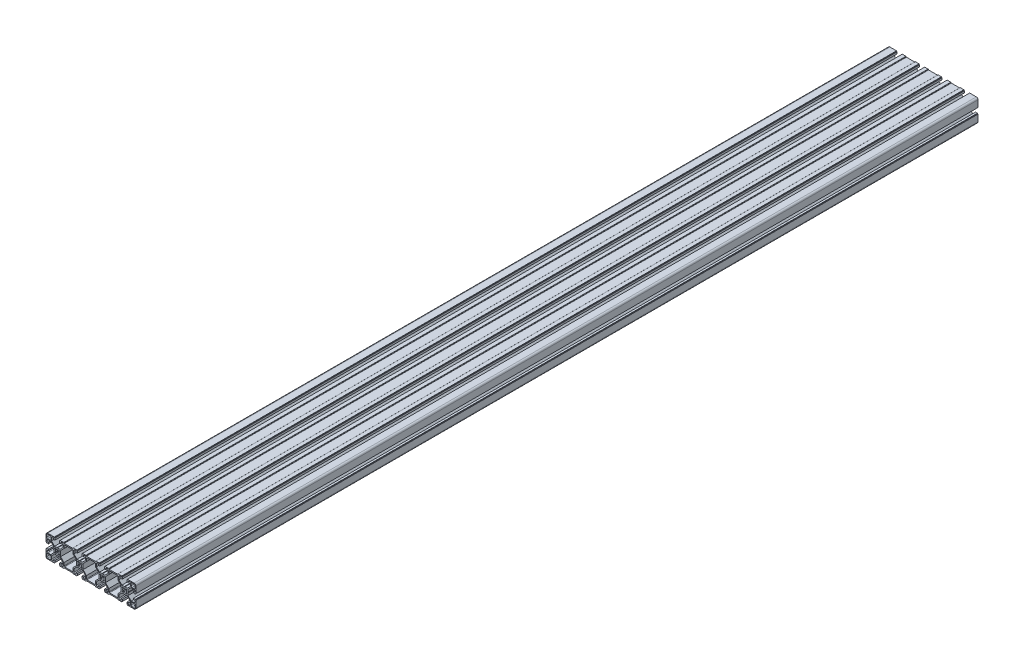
from build123d import *

# Parameters (mm, degrees)
EXTRUDE_1_DEPTH = 1500


with BuildPart() as part:
    # Sketch 1 → Extrude 1 (new body)
    with BuildSketch(Plane.XY):
        with BuildLine():
            Line((-46.46195512, 18.20767413), (-46.46195512, 18.18767413))
            ThreePointArc((-46.46195512, 18.18767413), (-46.318437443, 17.841191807), (-45.97195512, 17.69767413))
            Line((-45.97195512, 17.69767413), (-31.048621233, 17.69767413))
            ThreePointArc((-31.048621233, 17.69767413), (-30.70213891, 17.841191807), (-30.558621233, 18.18767413))
            Line((-30.558621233, 18.18767413), (-30.558621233, 18.20767413))
            ThreePointArc((-30.558621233, 18.20767413), (-30.415103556, 18.554156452), (-30.068621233, 18.69767413))
            Line((-30.068621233, 18.69767413), (-23.611627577, 18.69767413))
            Line((-23.611627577, 18.69767413), (-23.611627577, 17.69767413))
            Line((-23.611627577, 17.69767413), (-22.611627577, 17.69767413))
            Line((-22.611627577, 17.69767413), (-22.611627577, 14.29767413))
            Line((-22.611627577, 14.29767413), (-24.911627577, 14.29767413))
            Line((-24.911627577, 14.29767413), (-24.911627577, 15.49767413))
            ThreePointArc((-24.911627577, 15.49767413), (-25.350967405, 16.558334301), (-26.411627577, 16.99767413))
            Line((-26.411627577, 16.99767413), (-27.259656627, 16.99767413))
            ThreePointArc((-27.259656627, 16.99767413), (-28.320316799, 16.558334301), (-28.759656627, 15.49767413))
            Line((-28.759656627, 15.49767413), (-28.759656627, 10.212152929))
            Line((-28.759656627, 10.212152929), (-23.244124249, 4.69373497))
            Line((-23.244124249, 4.69373497), (-19.014798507, 4.69373497))
            Line((-19.014798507, 4.69373497), (-18.519368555, 4.198305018))
            Line((-18.519368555, 4.198305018), (-18.023938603, 4.69373497))
            Line((-18.023938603, 4.69373497), (-13.794612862, 4.69373497))
            Line((-13.794612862, 4.69373497), (-8.262990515, 10.231508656))
            Line((-8.262990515, 10.231508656), (-8.262990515, 15.49767413))
            ThreePointArc((-8.262990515, 15.49767413), (-8.702330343, 16.558334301), (-9.762990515, 16.99767413))
            Line((-9.762990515, 16.99767413), (-10.611627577, 16.99767413))
            ThreePointArc((-10.611627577, 16.99767413), (-11.672287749, 16.558334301), (-12.111627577, 15.49767413))
            Line((-12.111627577, 15.49767413), (-12.111627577, 14.29767413))
            Line((-12.111627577, 14.29767413), (-14.411627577, 14.29767413))
            Line((-14.411627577, 14.29767413), (-14.411627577, 17.69767413))
            Line((-14.411627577, 17.69767413), (-13.411627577, 17.69767413))
            Line((-13.411627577, 17.69767413), (-13.411627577, 18.69767413))
            Line((-13.411627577, 18.69767413), (-7.482990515, 18.69767413))
            ThreePointArc((-7.482990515, 18.69767413), (-7.136508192, 18.554156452), (-6.992990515, 18.20767413))
            Line((-6.992990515, 18.20767413), (-6.992990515, 18.18767413))
            ThreePointArc((-6.992990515, 18.18767413), (-6.849472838, 17.841191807), (-6.502990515, 17.69767413))
            Line((-6.502990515, 17.69767413), (9.480343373, 17.69767413))
            ThreePointArc((9.480343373, 17.69767413), (9.826825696, 17.841191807), (9.970343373, 18.18767413))
            Line((9.970343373, 18.18767413), (9.970343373, 18.20767413))
            ThreePointArc((9.970343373, 18.20767413), (10.11386105, 18.554156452), (10.460343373, 18.69767413))
            Line((10.460343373, 18.69767413), (16.388372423, 18.69767413))
            Line((16.388372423, 18.69767413), (16.388372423, 17.69767413))
            Line((16.388372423, 17.69767413), (17.388372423, 17.69767413))
            Line((17.388372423, 17.69767413), (17.388372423, 14.29767413))
            Line((17.388372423, 14.29767413), (15.088372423, 14.29767413))
            Line((15.088372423, 14.29767413), (15.088372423, 15.49767413))
            ThreePointArc((15.088372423, 15.49767413), (14.649032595, 16.558334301), (13.588372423, 16.99767413))
            Line((13.588372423, 16.99767413), (12.740343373, 16.99767413))
            ThreePointArc((12.740343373, 16.99767413), (11.679683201, 16.558334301), (11.240343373, 15.49767413))
            Line((11.240343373, 15.49767413), (11.240343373, 10.212152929))
            Line((11.240343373, 10.212152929), (16.755875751, 4.69373497))
            Line((16.755875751, 4.69373497), (20.985201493, 4.69373497))
            Line((20.985201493, 4.69373497), (21.480631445, 4.198305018))
            Line((21.480631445, 4.198305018), (21.976061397, 4.69373497))
            Line((21.976061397, 4.69373497), (26.205387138, 4.69373497))
            Line((26.205387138, 4.69373497), (31.737009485, 10.231508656))
            Line((31.737009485, 10.231508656), (31.737009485, 15.49767413))
            ThreePointArc((31.737009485, 15.49767413), (31.297669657, 16.558334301), (30.237009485, 16.99767413))
            Line((30.237009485, 16.99767413), (29.388372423, 16.99767413))
            ThreePointArc((29.388372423, 16.99767413), (28.327712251, 16.558334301), (27.888372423, 15.49767413))
            Line((27.888372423, 15.49767413), (27.888372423, 14.29767413))
            Line((27.888372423, 14.29767413), (25.588372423, 14.29767413))
            Line((25.588372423, 14.29767413), (25.588372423, 17.69767413))
            Line((25.588372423, 17.69767413), (26.588372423, 17.69767413))
            Line((26.588372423, 17.69767413), (26.588372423, 18.69767413))
            Line((26.588372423, 18.69767413), (33.04804488, 18.69767413))
            ThreePointArc((33.04804488, 18.69767413), (33.394527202, 18.554156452), (33.53804488, 18.20767413))
            Line((33.53804488, 18.20767413), (33.53804488, 18.18767413))
            ThreePointArc((33.53804488, 18.18767413), (33.681562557, 17.841191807), (34.02804488, 17.69767413))
            Line((34.02804488, 17.69767413), (48.951378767, 17.69767413))
            ThreePointArc((48.951378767, 17.69767413), (49.29786109, 17.841191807), (49.441378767, 18.18767413))
            Line((49.441378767, 18.18767413), (49.441378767, 18.20767413))
            ThreePointArc((49.441378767, 18.20767413), (49.584896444, 18.554156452), (49.931378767, 18.69767413))
            Line((49.931378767, 18.69767413), (56.388372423, 18.69767413))
            Line((56.388372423, 18.69767413), (56.388372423, 17.69767413))
            Line((56.388372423, 17.69767413), (57.388372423, 17.69767413))
            Line((57.388372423, 17.69767413), (57.388372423, 14.29767413))
            Line((57.388372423, 14.29767413), (55.088372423, 14.29767413))
            Line((55.088372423, 14.29767413), (55.088372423, 15.49767413))
            ThreePointArc((55.088372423, 15.49767413), (54.649032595, 16.558334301), (53.588372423, 16.99767413))
            Line((53.588372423, 16.99767413), (52.740343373, 16.99767413))
            ThreePointArc((52.740343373, 16.99767413), (51.679683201, 16.558334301), (51.240343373, 15.49767413))
            Line((51.240343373, 15.49767413), (51.240343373, 10.212152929))
            Line((51.240343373, 10.212152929), (56.755875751, 4.69373497))
            Line((56.755875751, 4.69373497), (60.985201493, 4.69373497))
            Line((60.985201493, 4.69373497), (61.480631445, 4.198305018))
            Line((61.480631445, 4.198305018), (61.976061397, 4.69373497))
            Line((61.976061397, 4.69373497), (66.205387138, 4.69373497))
            Line((66.205387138, 4.69373497), (71.737009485, 10.231508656))
            Line((71.737009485, 10.231508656), (71.737009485, 15.49767413))
            ThreePointArc((71.737009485, 15.49767413), (71.297669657, 16.558334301), (70.237009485, 16.99767413))
            Line((70.237009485, 16.99767413), (69.388372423, 16.99767413))
            ThreePointArc((69.388372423, 16.99767413), (68.327712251, 16.558334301), (67.888372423, 15.49767413))
            Line((67.888372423, 15.49767413), (67.888372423, 14.29767413))
            Line((67.888372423, 14.29767413), (65.588372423, 14.29767413))
            Line((65.588372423, 14.29767413), (65.588372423, 17.69767413))
            Line((65.588372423, 17.69767413), (66.588372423, 17.69767413))
            Line((66.588372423, 17.69767413), (66.588372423, 18.69767413))
            Line((66.588372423, 18.69767413), (78.488372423, 18.69767413))
            ThreePointArc((78.488372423, 18.69767413), (80.609692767, 17.818994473), (81.488372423, 15.69767413))
            Line((81.488372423, 15.69767413), (81.488372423, 3.799754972))
            Line((81.488372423, 3.799754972), (80.483128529, 3.799754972))
            Line((80.483128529, 3.799754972), (80.483128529, 2.799754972))
            Line((80.483128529, 2.799754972), (77.083128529, 2.799754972))
            Line((77.083128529, 2.799754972), (77.083128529, 5.099754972))
            Line((77.083128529, 5.099754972), (78.283128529, 5.099754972))
            ThreePointArc((78.283128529, 5.099754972), (79.3437887, 5.539094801), (79.783128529, 6.599754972))
            Line((79.783128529, 6.599754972), (79.783128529, 7.443844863))
            ThreePointArc((79.783128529, 7.443844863), (79.3437887, 8.504505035), (78.283128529, 8.943844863))
            Line((78.283128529, 8.943844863), (73.005580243, 8.943844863))
            Line((73.005580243, 8.943844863), (67.483128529, 3.423792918))
            Line((67.483128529, 3.423792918), (67.483128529, -0.814026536))
            Line((67.483128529, -0.814026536), (66.991921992, -1.305233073))
            Line((66.991921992, -1.305233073), (67.483128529, -1.79643961))
            Line((67.483128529, -1.79643961), (67.483128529, -6.034259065))
            Line((67.483128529, -6.034259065), (73.006735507, -11.558235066))
            Line((73.006735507, -11.558235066), (78.283128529, -11.558235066))
            ThreePointArc((78.283128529, -11.558235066), (79.3437887, -11.118895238), (79.783128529, -10.058235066))
            Line((79.783128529, -10.058235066), (79.783128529, -9.202325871))
            ThreePointArc((79.783128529, -9.202325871), (79.3437887, -8.141665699), (78.283128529, -7.702325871))
            Line((78.283128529, -7.702325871), (77.083128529, -7.702325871))
            Line((77.083128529, -7.702325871), (77.083128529, -5.402325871))
            Line((77.083128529, -5.402325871), (80.483128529, -5.402325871))
            Line((80.483128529, -5.402325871), (80.483128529, -6.402325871))
            Line((80.483128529, -6.402325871), (81.488372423, -6.402325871))
            Line((81.488372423, -6.402325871), (81.488372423, -18.302325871))
            ThreePointArc((81.488372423, -18.302325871), (80.609692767, -20.423646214), (78.488372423, -21.302325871))
            Line((78.488372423, -21.302325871), (66.588372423, -21.302325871))
            Line((66.588372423, -21.302325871), (66.588372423, -20.302325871))
            Line((66.588372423, -20.302325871), (65.588372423, -20.302325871))
            Line((65.588372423, -20.302325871), (65.588372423, -16.902325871))
            Line((65.588372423, -16.902325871), (67.888372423, -16.902325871))
            Line((67.888372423, -16.902325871), (67.888372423, -18.102325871))
            ThreePointArc((67.888372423, -18.102325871), (68.327712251, -19.162986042), (69.388372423, -19.602325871))
            Line((69.388372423, -19.602325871), (70.233426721, -19.602325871))
            ThreePointArc((70.233426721, -19.602325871), (71.294086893, -19.162986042), (71.733426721, -18.102325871))
            Line((71.733426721, -18.102325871), (71.733426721, -12.824801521))
            Line((71.733426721, -12.824801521), (66.210317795, -7.30626503))
            Line((66.210317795, -7.30626503), (61.979036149, -7.30626503))
            Line((61.979036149, -7.30626503), (61.480452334, -6.807681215))
            Line((61.480452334, -6.807681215), (60.981868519, -7.30626503))
            Line((60.981868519, -7.30626503), (56.750586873, -7.30626503))
            Line((56.750586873, -7.30626503), (51.238372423, -12.79900317))
            Line((51.238372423, -12.79900317), (51.238372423, -18.10232587))
            ThreePointArc((51.238372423, -18.10232587), (51.677712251, -19.162986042), (52.738372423, -19.60232587))
            Line((52.738372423, -19.60232587), (53.588372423, -19.60232587))
            ThreePointArc((53.588372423, -19.60232587), (54.649032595, -19.162986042), (55.088372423, -18.10232587))
            Line((55.088372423, -18.10232587), (55.088372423, -16.90232587))
            Line((55.088372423, -16.90232587), (57.388372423, -16.90232587))
            Line((57.388372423, -16.90232587), (57.388372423, -20.30232587))
            Line((57.388372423, -20.30232587), (56.388372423, -20.30232587))
            Line((56.388372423, -20.30232587), (56.388372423, -21.30232587))
            Line((56.388372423, -21.30232587), (49.922642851, -21.30232587))
            ThreePointArc((49.922642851, -21.30232587), (49.576160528, -21.158808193), (49.432642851, -20.81232587))
            Line((49.432642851, -20.81232587), (49.432642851, -20.79232587))
            ThreePointArc((49.432642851, -20.79232587), (49.289125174, -20.445843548), (48.942642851, -20.30232587))
            Line((48.942642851, -20.30232587), (34.017697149, -20.30232587))
            ThreePointArc((34.017697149, -20.30232587), (33.671214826, -20.445843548), (33.527697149, -20.79232587))
            Line((33.527697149, -20.79232587), (33.527697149, -20.81232587))
            ThreePointArc((33.527697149, -20.81232587), (33.384179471, -21.158808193), (33.037697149, -21.30232587))
            Line((33.037697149, -21.30232587), (26.588372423, -21.30232587))
            Line((26.588372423, -21.30232587), (26.588372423, -20.30232587))
            Line((26.588372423, -20.30232587), (25.588372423, -20.30232587))
            Line((25.588372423, -20.30232587), (25.588372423, -16.90232587))
            Line((25.588372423, -16.90232587), (27.888372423, -16.90232587))
            Line((27.888372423, -16.90232587), (27.888372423, -18.10232587))
            ThreePointArc((27.888372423, -18.10232587), (28.327712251, -19.162986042), (29.388372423, -19.60232587))
            Line((29.388372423, -19.60232587), (30.233426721, -19.60232587))
            ThreePointArc((30.233426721, -19.60232587), (31.294086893, -19.162986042), (31.733426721, -18.10232587))
            Line((31.733426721, -18.10232587), (31.733426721, -12.824801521))
            Line((31.733426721, -12.824801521), (26.210317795, -7.30626503))
            Line((26.210317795, -7.30626503), (21.979036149, -7.30626503))
            Line((21.979036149, -7.30626503), (21.480452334, -6.807681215))
            Line((21.480452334, -6.807681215), (20.981868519, -7.30626503))
            Line((20.981868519, -7.30626503), (16.750586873, -7.30626503))
            Line((16.750586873, -7.30626503), (11.238372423, -12.79900317))
            Line((11.238372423, -12.79900317), (11.238372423, -18.10232587))
            ThreePointArc((11.238372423, -18.10232587), (11.677712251, -19.162986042), (12.738372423, -19.60232587))
            Line((12.738372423, -19.60232587), (13.588372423, -19.60232587))
            ThreePointArc((13.588372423, -19.60232587), (14.649032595, -19.162986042), (15.088372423, -18.10232587))
            Line((15.088372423, -18.10232587), (15.088372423, -16.90232587))
            Line((15.088372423, -16.90232587), (17.388372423, -16.90232587))
            Line((17.388372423, -16.90232587), (17.388372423, -20.30232587))
            Line((17.388372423, -20.30232587), (16.388372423, -20.30232587))
            Line((16.388372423, -20.30232587), (16.388372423, -21.30232587))
            Line((16.388372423, -21.30232587), (10.458372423, -21.30232587))
            ThreePointArc((10.458372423, -21.30232587), (10.1118901, -21.158808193), (9.968372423, -20.81232587))
            Line((9.968372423, -20.81232587), (9.968372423, -20.79232587))
            ThreePointArc((9.968372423, -20.79232587), (9.824854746, -20.445843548), (9.478372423, -20.30232587))
            Line((9.478372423, -20.30232587), (-6.506573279, -20.30232587))
            ThreePointArc((-6.506573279, -20.30232587), (-6.853055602, -20.445843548), (-6.996573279, -20.79232587))
            Line((-6.996573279, -20.79232587), (-6.996573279, -20.81232587))
            ThreePointArc((-6.996573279, -20.81232587), (-7.140090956, -21.158808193), (-7.486573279, -21.30232587))
            Line((-7.486573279, -21.30232587), (-13.411627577, -21.30232587))
            Line((-13.411627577, -21.30232587), (-13.411627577, -20.30232587))
            Line((-13.411627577, -20.30232587), (-14.411627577, -20.30232587))
            Line((-14.411627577, -20.30232587), (-14.411627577, -16.90232587))
            Line((-14.411627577, -16.90232587), (-12.111627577, -16.90232587))
            Line((-12.111627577, -16.90232587), (-12.111627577, -18.10232587))
            ThreePointArc((-12.111627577, -18.10232587), (-11.672287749, -19.162986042), (-10.611627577, -19.60232587))
            Line((-10.611627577, -19.60232587), (-9.766573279, -19.60232587))
            ThreePointArc((-9.766573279, -19.60232587), (-8.705913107, -19.162986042), (-8.266573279, -18.10232587))
            Line((-8.266573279, -18.10232587), (-8.266573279, -12.824801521))
            Line((-8.266573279, -12.824801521), (-13.789682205, -7.30626503))
            Line((-13.789682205, -7.30626503), (-18.020963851, -7.30626503))
            Line((-18.020963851, -7.30626503), (-18.519547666, -6.807681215))
            Line((-18.519547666, -6.807681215), (-19.018131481, -7.30626503))
            Line((-19.018131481, -7.30626503), (-23.249413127, -7.30626503))
            Line((-23.249413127, -7.30626503), (-28.761627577, -12.79900317))
            Line((-28.761627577, -12.79900317), (-28.761627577, -18.10232587))
            ThreePointArc((-28.761627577, -18.10232587), (-28.322287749, -19.162986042), (-27.261627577, -19.60232587))
            Line((-27.261627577, -19.60232587), (-26.411627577, -19.60232587))
            ThreePointArc((-26.411627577, -19.60232587), (-25.350967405, -19.162986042), (-24.911627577, -18.10232587))
            Line((-24.911627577, -18.10232587), (-24.911627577, -16.90232587))
            Line((-24.911627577, -16.90232587), (-22.611627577, -16.90232587))
            Line((-22.611627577, -16.90232587), (-22.611627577, -20.30232587))
            Line((-22.611627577, -20.30232587), (-23.611627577, -20.30232587))
            Line((-23.611627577, -20.30232587), (-23.611627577, -21.30232587))
            Line((-23.611627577, -21.30232587), (-30.077357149, -21.30232587))
            ThreePointArc((-30.077357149, -21.30232587), (-30.423839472, -21.158808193), (-30.567357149, -20.81232587))
            Line((-30.567357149, -20.81232587), (-30.567357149, -20.79232587))
            ThreePointArc((-30.567357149, -20.79232587), (-30.710874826, -20.445843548), (-31.057357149, -20.30232587))
            Line((-31.057357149, -20.30232587), (-45.982302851, -20.30232587))
            ThreePointArc((-45.982302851, -20.30232587), (-46.328785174, -20.445843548), (-46.472302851, -20.79232587))
            Line((-46.472302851, -20.79232587), (-46.472302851, -20.81232587))
            ThreePointArc((-46.472302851, -20.81232587), (-46.615820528, -21.158808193), (-46.962302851, -21.30232587))
            Line((-46.962302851, -21.30232587), (-53.411627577, -21.30232587))
            Line((-53.411627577, -21.30232587), (-53.411627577, -20.30232587))
            Line((-53.411627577, -20.30232587), (-54.411627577, -20.30232587))
            Line((-54.411627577, -20.30232587), (-54.411627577, -16.90232587))
            Line((-54.411627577, -16.90232587), (-52.111627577, -16.90232587))
            Line((-52.111627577, -16.90232587), (-52.111627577, -18.10232587))
            ThreePointArc((-52.111627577, -18.10232587), (-51.672287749, -19.162986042), (-50.611627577, -19.60232587))
            Line((-50.611627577, -19.60232587), (-49.766573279, -19.60232587))
            ThreePointArc((-49.766573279, -19.60232587), (-48.705913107, -19.162986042), (-48.266573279, -18.10232587))
            Line((-48.266573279, -18.10232587), (-48.266573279, -12.824801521))
            Line((-48.266573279, -12.824801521), (-53.789682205, -7.30626503))
            Line((-53.789682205, -7.30626503), (-58.020963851, -7.30626503))
            Line((-58.020963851, -7.30626503), (-58.519547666, -6.807681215))
            Line((-58.519547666, -6.807681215), (-59.018131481, -7.30626503))
            Line((-59.018131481, -7.30626503), (-63.249413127, -7.30626503))
            Line((-63.249413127, -7.30626503), (-68.761627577, -12.79900317))
            Line((-68.761627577, -12.79900317), (-68.761627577, -18.10232587))
            ThreePointArc((-68.761627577, -18.10232587), (-68.322287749, -19.162986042), (-67.261627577, -19.60232587))
            Line((-67.261627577, -19.60232587), (-66.411627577, -19.60232587))
            ThreePointArc((-66.411627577, -19.60232587), (-65.350967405, -19.162986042), (-64.911627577, -18.10232587))
            Line((-64.911627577, -18.10232587), (-64.911627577, -16.90232587))
            Line((-64.911627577, -16.90232587), (-62.611627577, -16.90232587))
            Line((-62.611627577, -16.90232587), (-62.611627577, -20.30232587))
            Line((-62.611627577, -20.30232587), (-63.611627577, -20.30232587))
            Line((-63.611627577, -20.30232587), (-63.611627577, -21.30232587))
            Line((-63.611627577, -21.30232587), (-75.511627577, -21.30232587))
            ThreePointArc((-75.511627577, -21.30232587), (-77.63294792, -20.423646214), (-78.511627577, -18.30232587))
            Line((-78.511627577, -18.30232587), (-78.511627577, -6.40232587))
            Line((-78.511627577, -6.40232587), (-77.511627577, -6.40232587))
            Line((-77.511627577, -6.40232587), (-77.511627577, -5.40232587))
            Line((-77.511627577, -5.40232587), (-74.111627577, -5.40232587))
            Line((-74.111627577, -5.40232587), (-74.111627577, -7.70232587))
            Line((-74.111627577, -7.70232587), (-75.311627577, -7.70232587))
            ThreePointArc((-75.311627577, -7.70232587), (-76.372287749, -8.141665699), (-76.811627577, -9.20232587))
            Line((-76.811627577, -9.20232587), (-76.811627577, -10.05232587))
            ThreePointArc((-76.811627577, -10.05232587), (-76.372287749, -11.112986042), (-75.311627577, -11.55232587))
            Line((-75.311627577, -11.55232587), (-70.039111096, -11.55232587))
            Line((-70.039111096, -11.55232587), (-64.511627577, -6.024842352))
            Line((-64.511627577, -6.024842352), (-64.511627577, -1.80727247))
            Line((-64.511627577, -1.80727247), (-64.010724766, -1.30636966))
            Line((-64.010724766, -1.30636966), (-64.511627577, -0.805466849))
            Line((-64.511627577, -0.805466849), (-64.511627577, 3.412103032))
            Line((-64.511627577, 3.412103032), (-70.038483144, 8.938330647))
            Line((-70.038483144, 8.938330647), (-75.311627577, 8.938330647))
            ThreePointArc((-75.311627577, 8.938330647), (-76.372287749, 8.498990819), (-76.811627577, 7.438330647))
            Line((-76.811627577, 7.438330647), (-76.811627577, 6.590299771))
            ThreePointArc((-76.811627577, 6.590299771), (-76.372287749, 5.529639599), (-75.311627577, 5.090299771))
            Line((-75.311627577, 5.090299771), (-74.111627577, 5.090299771))
            Line((-74.111627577, 5.090299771), (-74.111627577, 2.79767413))
            Line((-74.111627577, 2.79767413), (-77.511627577, 2.79767413))
            Line((-77.511627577, 2.79767413), (-77.511627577, 3.79767413))
            Line((-77.511627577, 3.79767413), (-78.511627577, 3.79767413))
            Line((-78.511627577, 3.79767413), (-78.511627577, 15.69767413))
            ThreePointArc((-78.511627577, 15.69767413), (-77.63294792, 17.818994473), (-75.511627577, 18.69767413))
            Line((-75.511627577, 18.69767413), (-63.611627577, 18.69767413))
            Line((-63.611627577, 18.69767413), (-63.611627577, 17.69767413))
            Line((-63.611627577, 17.69767413), (-62.611627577, 17.69767413))
            Line((-62.611627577, 17.69767413), (-62.611627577, 14.29767413))
            Line((-62.611627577, 14.29767413), (-64.911627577, 14.29767413))
            Line((-64.911627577, 14.29767413), (-64.911627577, 15.49767413))
            ThreePointArc((-64.911627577, 15.49767413), (-65.350967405, 16.558334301), (-66.411627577, 16.99767413))
            Line((-66.411627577, 16.99767413), (-67.259656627, 16.99767413))
            ThreePointArc((-67.259656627, 16.99767413), (-68.320316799, 16.558334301), (-68.759656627, 15.49767413))
            Line((-68.759656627, 15.49767413), (-68.759656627, 10.212152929))
            Line((-68.759656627, 10.212152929), (-63.244124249, 4.69373497))
            Line((-63.244124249, 4.69373497), (-59.014798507, 4.69373497))
            Line((-59.014798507, 4.69373497), (-58.519368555, 4.198305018))
            Line((-58.519368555, 4.198305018), (-58.023938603, 4.69373497))
            Line((-58.023938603, 4.69373497), (-53.794612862, 4.69373497))
            Line((-53.794612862, 4.69373497), (-48.262990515, 10.231508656))
            Line((-48.262990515, 10.231508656), (-48.262990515, 15.49767413))
            ThreePointArc((-48.262990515, 15.49767413), (-48.702330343, 16.558334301), (-49.762990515, 16.99767413))
            Line((-49.762990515, 16.99767413), (-50.611627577, 16.99767413))
            ThreePointArc((-50.611627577, 16.99767413), (-51.672287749, 16.558334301), (-52.111627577, 15.49767413))
            Line((-52.111627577, 15.49767413), (-52.111627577, 14.29767413))
            Line((-52.111627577, 14.29767413), (-54.411627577, 14.29767413))
            Line((-54.411627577, 14.29767413), (-54.411627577, 17.69767413))
            Line((-54.411627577, 17.69767413), (-53.411627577, 17.69767413))
            Line((-53.411627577, 17.69767413), (-53.411627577, 18.69767413))
            Line((-53.411627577, 18.69767413), (-46.95195512, 18.69767413))
            ThreePointArc((-46.95195512, 18.69767413), (-46.605472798, 18.554156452), (-46.46195512, 18.20767413))
        make_face()
        with BuildLine():
            Line((-69.855066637, 11.845705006), (-69.855066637, 15.69767413))
            ThreePointArc((-69.855066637, 15.69767413), (-70.382274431, 16.970466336), (-71.655066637, 17.49767413))
            Line((-71.655066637, 17.49767413), (-75.507037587, 17.49767413))
            ThreePointArc((-75.507037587, 17.49767413), (-76.779829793, 16.970466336), (-77.307037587, 15.69767413))
            Line((-77.307037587, 15.69767413), (-77.307037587, 11.845705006))
            ThreePointArc((-77.307037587, 11.845705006), (-76.779829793, 10.5729128), (-75.507037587, 10.045705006))
            Line((-75.507037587, 10.045705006), (-71.655066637, 10.045705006))
            ThreePointArc((-71.655066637, 10.045705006), (-70.382274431, 10.5729128), (-69.855066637, 11.845705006))
        make_face(mode=Mode.SUBTRACT)
        with BuildLine():
            Line((74.640991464, -12.658235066), (78.492962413, -12.658235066))
            ThreePointArc((78.492962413, -12.658235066), (79.765754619, -13.18544286), (80.292962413, -14.458235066))
            Line((80.292962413, -14.458235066), (80.292962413, -18.30232587))
            ThreePointArc((80.292962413, -18.30232587), (79.765754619, -19.575118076), (78.492962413, -20.10232587))
            Line((78.492962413, -20.10232587), (74.640991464, -20.10232587))
            ThreePointArc((74.640991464, -20.10232587), (73.368199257, -19.575118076), (72.840991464, -18.30232587))
            Line((72.840991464, -18.30232587), (72.840991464, -14.458235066))
            ThreePointArc((72.840991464, -14.458235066), (73.368199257, -13.18544286), (74.640991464, -12.658235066))
        make_face(mode=Mode.SUBTRACT)
        with BuildLine():
            Line((78.492962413, 17.49767413), (74.644932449, 17.49767413))
            ThreePointArc((74.644932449, 17.49767413), (73.372140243, 16.970466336), (72.844932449, 15.69767413))
            Line((72.844932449, 15.69767413), (72.844932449, 11.841764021))
            ThreePointArc((72.844932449, 11.841764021), (73.372140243, 10.568971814), (74.644932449, 10.041764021))
            Line((74.644932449, 10.041764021), (78.492962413, 10.041764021))
            ThreePointArc((78.492962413, 10.041764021), (79.765754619, 10.568971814), (80.292962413, 11.841764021))
            Line((80.292962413, 11.841764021), (80.292962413, 15.69767413))
            ThreePointArc((80.292962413, 15.69767413), (79.765754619, 16.970466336), (78.492962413, 17.49767413))
        make_face(mode=Mode.SUBTRACT)
        with BuildLine():
            Line((8.440343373, 15.69767413), (-5.462990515, 15.69767413))
            ThreePointArc((-5.462990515, 15.69767413), (-6.170097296, 15.404780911), (-6.462990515, 14.69767413))
            Line((-6.462990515, 14.69767413), (-6.462990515, 9.477673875))
            Line((-6.462990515, 9.477673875), (-12.516871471, 3.423792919))
            Line((-12.516871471, 3.423792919), (-12.516871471, -6.034259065))
            Line((-12.516871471, -6.034259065), (-6.466573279, -12.084557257))
            Line((-6.466573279, -12.084557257), (-6.466573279, -17.30232587))
            ThreePointArc((-6.466573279, -17.30232587), (-6.17368006, -18.009432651), (-5.466573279, -18.30232587))
            Line((-5.466573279, -18.30232587), (8.438372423, -18.30232587))
            ThreePointArc((8.438372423, -18.30232587), (9.145479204, -18.009432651), (9.438372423, -17.30232587))
            Line((9.438372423, -17.30232587), (9.438372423, -12.074842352))
            Line((9.438372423, -12.074842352), (15.488372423, -6.024842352))
            Line((15.488372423, -6.024842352), (15.488372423, 3.412103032))
            Line((15.488372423, 3.412103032), (9.440343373, 9.460132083))
            Line((9.440343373, 9.460132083), (9.440343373, 14.69767413))
            ThreePointArc((9.440343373, 14.69767413), (9.147450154, 15.404780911), (8.440343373, 15.69767413))
        make_face(mode=Mode.SUBTRACT)
        with BuildLine():
            Line((34.53804488, 15.69767413), (48.441378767, 15.69767413))
            ThreePointArc((48.441378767, 15.69767413), (49.148485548, 15.404780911), (49.441378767, 14.69767413))
            Line((49.441378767, 14.69767413), (49.441378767, 9.424106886))
            Line((49.441378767, 9.424106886), (55.454010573, 3.412103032))
            Line((55.454010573, 3.412103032), (55.453115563, -6.024842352))
            Line((55.453115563, -6.024842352), (49.432642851, -12.045315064))
            Line((49.432642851, -12.045315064), (49.432642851, -17.30232587))
            ThreePointArc((49.432642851, -17.30232587), (49.139749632, -18.009432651), (48.432642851, -18.30232587))
            Line((48.432642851, -18.30232587), (34.527697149, -18.30232587))
            ThreePointArc((34.527697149, -18.30232587), (33.820590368, -18.009432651), (33.527697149, -17.30232587))
            Line((33.527697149, -17.30232587), (33.527697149, -12.079196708))
            Line((33.527697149, -12.079196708), (27.483128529, -6.034259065))
            Line((27.483128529, -6.034259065), (27.483128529, 3.423792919))
            Line((27.483128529, 3.423792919), (33.53804488, 9.4763095))
            Line((33.53804488, 9.4763095), (33.53804488, 14.69767413))
            ThreePointArc((33.53804488, 14.69767413), (33.830938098, 15.404780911), (34.53804488, 15.69767413))
        make_face(mode=Mode.SUBTRACT)
        with BuildLine():
            Line((25.558826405, -4.66502224), (24.851719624, -5.372129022))
            ThreePointArc((24.851719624, -5.372129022), (24.498166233, -5.518575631), (24.144612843, -5.372129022))
            Line((24.144612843, -5.372129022), (23.083680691, -4.31119687))
            ThreePointArc((23.083680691, -4.31119687), (21.492962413, -4.70626503), (19.902244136, -4.31119687))
            Line((19.902244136, -4.31119687), (18.841311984, -5.372129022))
            ThreePointArc((18.841311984, -5.372129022), (18.487758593, -5.518575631), (18.134205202, -5.372129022))
            Line((18.134205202, -5.372129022), (17.427098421, -4.66502224))
            ThreePointArc((17.427098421, -4.66502224), (17.280651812, -4.31146885), (17.427098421, -3.957915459))
            Line((17.427098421, -3.957915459), (18.488030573, -2.896983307))
            ThreePointArc((18.488030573, -2.896983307), (18.092962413, -1.30626503), (18.488030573, 0.284453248))
            Line((18.488030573, 0.284453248), (17.427098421, 1.3453854))
            ThreePointArc((17.427098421, 1.3453854), (17.280651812, 1.69893879), (17.427098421, 2.052492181))
            Line((17.427098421, 2.052492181), (18.134205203, 2.759598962))
            ThreePointArc((18.134205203, 2.759598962), (18.487758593, 2.906045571), (18.841311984, 2.759598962))
            Line((18.841311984, 2.759598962), (19.902244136, 1.69866681))
            ThreePointArc((19.902244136, 1.69866681), (21.492962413, 2.09373497), (23.083680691, 1.69866681))
            Line((23.083680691, 1.69866681), (24.144612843, 2.759598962))
            ThreePointArc((24.144612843, 2.759598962), (24.498166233, 2.906045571), (24.851719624, 2.759598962))
            Line((24.851719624, 2.759598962), (25.558826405, 2.052492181))
            ThreePointArc((25.558826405, 2.052492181), (25.705273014, 1.69893879), (25.558826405, 1.3453854))
            Line((25.558826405, 1.3453854), (24.497894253, 0.284453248))
            ThreePointArc((24.497894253, 0.284453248), (24.892962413, -1.30626503), (24.497894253, -2.896983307))
            Line((24.497894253, -2.896983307), (25.558826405, -3.957915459))
            ThreePointArc((25.558826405, -3.957915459), (25.705273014, -4.31146885), (25.558826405, -4.66502224))
        make_face(mode=Mode.SUBTRACT)
        with BuildLine():
            Line((-20.097755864, -4.31119687), (-21.158688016, -5.372129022))
            ThreePointArc((-21.158688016, -5.372129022), (-21.512241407, -5.518575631), (-21.865794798, -5.372129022))
            Line((-21.865794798, -5.372129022), (-22.572901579, -4.66502224))
            ThreePointArc((-22.572901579, -4.66502224), (-22.719348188, -4.31146885), (-22.572901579, -3.957915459))
            Line((-22.572901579, -3.957915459), (-21.511969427, -2.896983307))
            ThreePointArc((-21.511969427, -2.896983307), (-21.907037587, -1.30626503), (-21.511969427, 0.284453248))
            Line((-21.511969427, 0.284453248), (-22.572901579, 1.3453854))
            ThreePointArc((-22.572901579, 1.3453854), (-22.719348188, 1.69893879), (-22.572901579, 2.052492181))
            Line((-22.572901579, 2.052492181), (-21.865794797, 2.759598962))
            ThreePointArc((-21.865794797, 2.759598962), (-21.512241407, 2.906045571), (-21.158688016, 2.759598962))
            Line((-21.158688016, 2.759598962), (-20.097755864, 1.69866681))
            ThreePointArc((-20.097755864, 1.69866681), (-18.507037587, 2.09373497), (-16.916319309, 1.69866681))
            Line((-16.916319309, 1.69866681), (-15.855387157, 2.759598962))
            ThreePointArc((-15.855387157, 2.759598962), (-15.501833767, 2.906045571), (-15.148280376, 2.759598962))
            Line((-15.148280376, 2.759598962), (-14.441173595, 2.052492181))
            ThreePointArc((-14.441173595, 2.052492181), (-14.294726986, 1.69893879), (-14.441173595, 1.3453854))
            Line((-14.441173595, 1.3453854), (-15.502105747, 0.284453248))
            ThreePointArc((-15.502105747, 0.284453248), (-15.107037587, -1.30626503), (-15.502105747, -2.896983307))
            Line((-15.502105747, -2.896983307), (-14.441173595, -3.957915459))
            ThreePointArc((-14.441173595, -3.957915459), (-14.294726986, -4.31146885), (-14.441173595, -4.66502224))
            Line((-14.441173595, -4.66502224), (-15.148280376, -5.372129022))
            ThreePointArc((-15.148280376, -5.372129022), (-15.501833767, -5.518575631), (-15.855387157, -5.372129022))
            Line((-15.855387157, -5.372129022), (-16.916319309, -4.31119687))
            ThreePointArc((-16.916319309, -4.31119687), (-18.507037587, -4.70626503), (-20.097755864, -4.31119687))
        make_face(mode=Mode.SUBTRACT)
        with BuildLine():
            Line((-55.855387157, 2.759598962), (-56.916319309, 1.69866681))
            ThreePointArc((-56.916319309, 1.69866681), (-58.507037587, 2.09373497), (-60.097755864, 1.69866681))
            Line((-60.097755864, 1.69866681), (-61.158688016, 2.759598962))
            ThreePointArc((-61.158688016, 2.759598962), (-61.512241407, 2.906045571), (-61.865794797, 2.759598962))
            Line((-61.865794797, 2.759598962), (-62.572901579, 2.052492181))
            ThreePointArc((-62.572901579, 2.052492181), (-62.719348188, 1.69893879), (-62.572901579, 1.3453854))
            Line((-62.572901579, 1.3453854), (-61.511969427, 0.284453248))
            ThreePointArc((-61.511969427, 0.284453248), (-61.907037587, -1.30626503), (-61.511969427, -2.896983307))
            Line((-61.511969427, -2.896983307), (-62.572901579, -3.957915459))
            ThreePointArc((-62.572901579, -3.957915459), (-62.719348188, -4.31146885), (-62.572901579, -4.66502224))
            Line((-62.572901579, -4.66502224), (-61.865794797, -5.372129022))
            ThreePointArc((-61.865794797, -5.372129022), (-61.512241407, -5.518575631), (-61.158688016, -5.372129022))
            Line((-61.158688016, -5.372129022), (-60.097755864, -4.31119687))
            ThreePointArc((-60.097755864, -4.31119687), (-58.507037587, -4.70626503), (-56.916319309, -4.31119687))
            Line((-56.916319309, -4.31119687), (-55.855387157, -5.372129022))
            ThreePointArc((-55.855387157, -5.372129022), (-55.501833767, -5.518575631), (-55.148280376, -5.372129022))
            Line((-55.148280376, -5.372129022), (-54.441173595, -4.66502224))
            ThreePointArc((-54.441173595, -4.66502224), (-54.294726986, -4.31146885), (-54.441173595, -3.957915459))
            Line((-54.441173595, -3.957915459), (-55.502105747, -2.896983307))
            ThreePointArc((-55.502105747, -2.896983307), (-55.107037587, -1.30626503), (-55.502105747, 0.284453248))
            Line((-55.502105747, 0.284453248), (-54.441173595, 1.3453854))
            ThreePointArc((-54.441173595, 1.3453854), (-54.294726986, 1.69893879), (-54.441173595, 2.052492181))
            Line((-54.441173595, 2.052492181), (-55.148280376, 2.759598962))
            ThreePointArc((-55.148280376, 2.759598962), (-55.501833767, 2.906045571), (-55.855387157, 2.759598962))
        make_face(mode=Mode.SUBTRACT)
        with BuildLine():
            Line((64.851719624, -5.372129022), (65.558826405, -4.66502224))
            ThreePointArc((65.558826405, -4.66502224), (65.705273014, -4.31146885), (65.558826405, -3.957915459))
            Line((65.558826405, -3.957915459), (64.497894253, -2.896983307))
            ThreePointArc((64.497894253, -2.896983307), (64.892962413, -1.30626503), (64.497894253, 0.284453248))
            Line((64.497894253, 0.284453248), (65.558826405, 1.3453854))
            ThreePointArc((65.558826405, 1.3453854), (65.705273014, 1.69893879), (65.558826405, 2.052492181))
            Line((65.558826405, 2.052492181), (64.851719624, 2.759598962))
            ThreePointArc((64.851719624, 2.759598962), (64.498166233, 2.906045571), (64.144612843, 2.759598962))
            Line((64.144612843, 2.759598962), (63.083680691, 1.69866681))
            ThreePointArc((63.083680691, 1.69866681), (61.492962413, 2.09373497), (59.902244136, 1.69866681))
            Line((59.902244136, 1.69866681), (58.841311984, 2.759598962))
            ThreePointArc((58.841311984, 2.759598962), (58.487758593, 2.906045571), (58.134205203, 2.759598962))
            Line((58.134205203, 2.759598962), (57.427098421, 2.052492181))
            ThreePointArc((57.427098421, 2.052492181), (57.280651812, 1.69893879), (57.427098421, 1.3453854))
            Line((57.427098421, 1.3453854), (58.488030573, 0.284453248))
            ThreePointArc((58.488030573, 0.284453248), (58.092962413, -1.30626503), (58.488030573, -2.896983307))
            Line((58.488030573, -2.896983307), (57.427098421, -3.957915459))
            ThreePointArc((57.427098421, -3.957915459), (57.280651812, -4.31146885), (57.427098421, -4.66502224))
            Line((57.427098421, -4.66502224), (58.134205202, -5.372129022))
            ThreePointArc((58.134205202, -5.372129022), (58.487758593, -5.518575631), (58.841311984, -5.372129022))
            Line((58.841311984, -5.372129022), (59.902244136, -4.31119687))
            ThreePointArc((59.902244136, -4.31119687), (61.492962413, -4.70626503), (63.083680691, -4.31119687))
            Line((63.083680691, -4.31119687), (64.144612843, -5.372129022))
            ThreePointArc((64.144612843, -5.372129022), (64.498166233, -5.518575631), (64.851719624, -5.372129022))
        make_face(mode=Mode.SUBTRACT)
        with BuildLine():
            Line((-45.472302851, -18.30232587), (-31.567357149, -18.30232587))
            ThreePointArc((-31.567357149, -18.30232587), (-30.860250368, -18.009432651), (-30.567357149, -17.30232587))
            Line((-30.567357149, -17.30232587), (-30.567357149, -12.045315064))
            Line((-30.567357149, -12.045315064), (-24.546884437, -6.024842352))
            Line((-24.546884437, -6.024842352), (-24.545989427, 3.412103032))
            Line((-24.545989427, 3.412103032), (-30.558621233, 9.424106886))
            Line((-30.558621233, 9.424106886), (-30.558621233, 14.69767413))
            ThreePointArc((-30.558621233, 14.69767413), (-30.851514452, 15.404780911), (-31.558621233, 15.69767413))
            Line((-31.558621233, 15.69767413), (-45.46195512, 15.69767413))
            ThreePointArc((-45.46195512, 15.69767413), (-46.169061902, 15.404780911), (-46.46195512, 14.69767413))
            Line((-46.46195512, 14.69767413), (-46.46195512, 9.4763095))
            Line((-46.46195512, 9.4763095), (-52.516871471, 3.423792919))
            Line((-52.516871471, 3.423792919), (-52.516871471, -6.034259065))
            Line((-52.516871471, -6.034259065), (-46.472302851, -12.079196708))
            Line((-46.472302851, -12.079196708), (-46.472302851, -17.30232587))
            ThreePointArc((-46.472302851, -17.30232587), (-46.179409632, -18.009432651), (-45.472302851, -18.30232587))
        make_face(mode=Mode.SUBTRACT)
        with BuildLine():
            Line((-77.307037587, -18.30232587), (-77.307037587, -14.45232587))
            ThreePointArc((-77.307037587, -14.45232587), (-76.779829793, -13.179533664), (-75.507037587, -12.65232587))
            Line((-75.507037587, -12.65232587), (-71.657037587, -12.65232587))
            ThreePointArc((-71.657037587, -12.65232587), (-70.384245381, -13.179533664), (-69.857037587, -14.45232587))
            Line((-69.857037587, -14.45232587), (-69.857037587, -18.30232587))
            ThreePointArc((-69.857037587, -18.30232587), (-70.384245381, -19.575118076), (-71.657037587, -20.10232587))
            Line((-71.657037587, -20.10232587), (-75.507037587, -20.10232587))
            ThreePointArc((-75.507037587, -20.10232587), (-76.779829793, -19.575118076), (-77.307037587, -18.30232587))
        make_face(mode=Mode.SUBTRACT)
    extrude(amount=EXTRUDE_1_DEPTH)


solid = part.part
